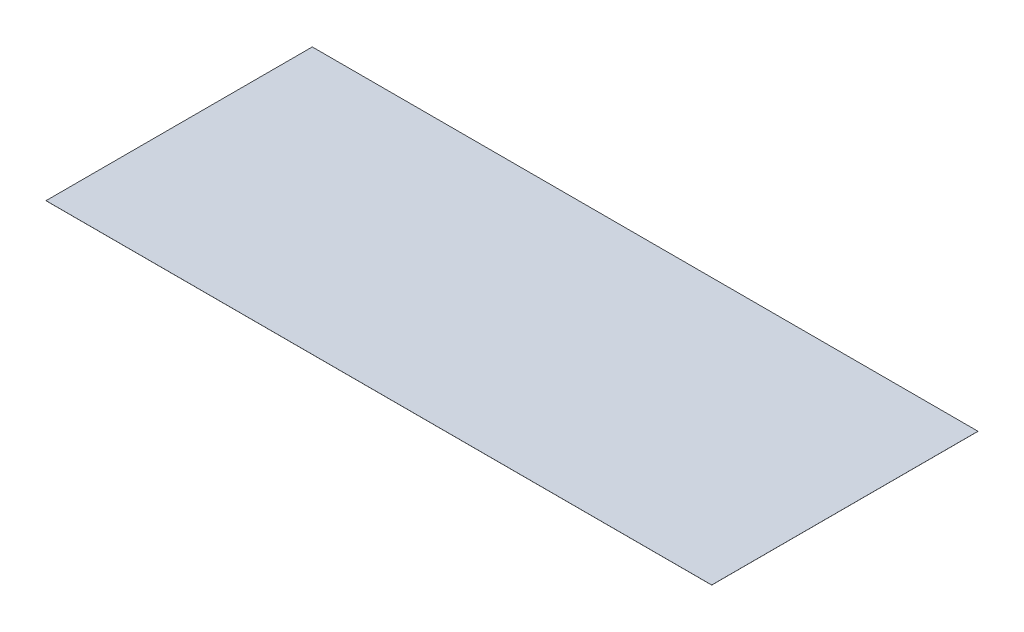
from build123d import *

# Parameters (mm, degrees)
ESQUISSE1_W        = 10000
ESQUISSE1_H        = 1
EXTRU_MINCE1_DEPTH = 4000


with BuildPart() as part:
    # Esquisse1 → Extru.-Mince1 (new body)
    with BuildSketch(Plane.XY):
        with Locations((-5000, -0.5)):
            Rectangle(ESQUISSE1_W, ESQUISSE1_H)
    extrude(amount=EXTRU_MINCE1_DEPTH)


solid = part.part
